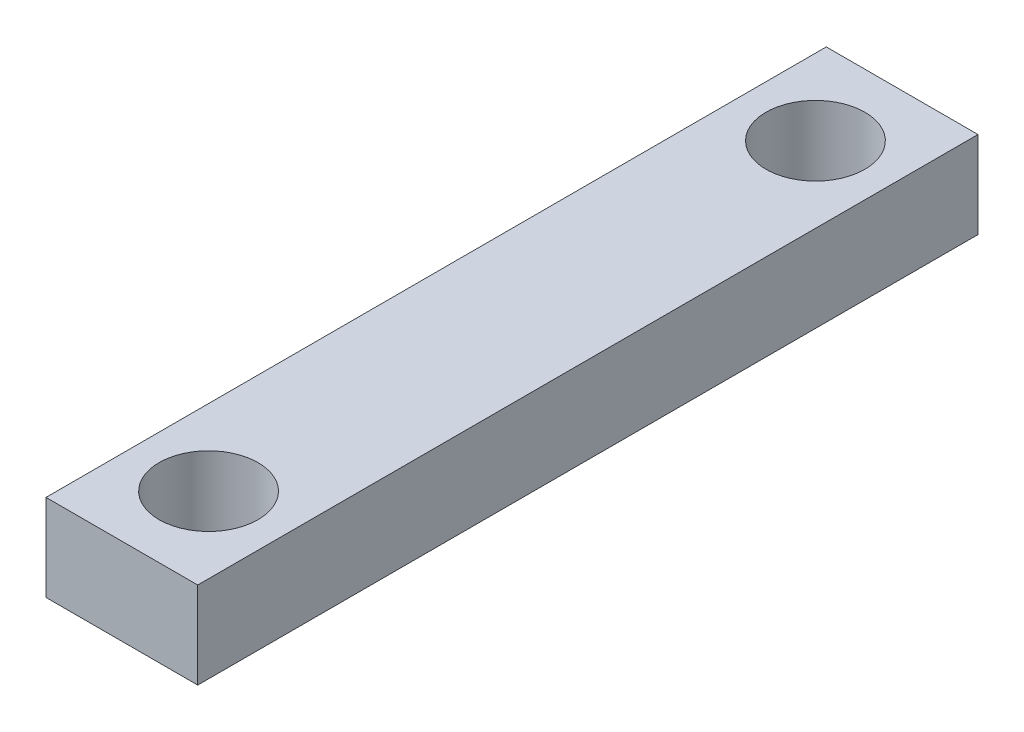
ISO-10303-21;
HEADER;
FILE_DESCRIPTION(('STEP AP214'),'2;1');
FILE_NAME('part.step','',(''),(''),'','','');
FILE_SCHEMA(('AUTOMOTIVE_DESIGN { 1 0 10303 214 1 1 1 1 }'));
ENDSEC;
DATA;
#1=APPLICATION_CONTEXT('core data for automotive mechanical design processes');
#2=APPLICATION_PROTOCOL_DEFINITION('international standard','automotive_design',2000,#1);
#3=PRODUCT_CONTEXT('',#1,'mechanical');
#4=PRODUCT('Part','Part','',(#3));
#5=PRODUCT_RELATED_PRODUCT_CATEGORY('part','',(#4));
#6=PRODUCT_DEFINITION_FORMATION('','',#4);
#7=PRODUCT_DEFINITION_CONTEXT('part definition',#1,'design');
#8=PRODUCT_DEFINITION('design','',#6,#7);
#9=PRODUCT_DEFINITION_SHAPE('','',#8);
#10=(LENGTH_UNIT() NAMED_UNIT(*) SI_UNIT(.MILLI.,.METRE.));
#11=(NAMED_UNIT(*) PLANE_ANGLE_UNIT() SI_UNIT($,.RADIAN.));
#12=(NAMED_UNIT(*) SI_UNIT($,.STERADIAN.) SOLID_ANGLE_UNIT());
#13=UNCERTAINTY_MEASURE_WITH_UNIT(LENGTH_MEASURE(1.E-05),#10,'distance_accuracy_value','');
#14=(GEOMETRIC_REPRESENTATION_CONTEXT(3) GLOBAL_UNCERTAINTY_ASSIGNED_CONTEXT((#13)) GLOBAL_UNIT_ASSIGNED_CONTEXT((#10,
#11,#12)) REPRESENTATION_CONTEXT('',''));
#15=CARTESIAN_POINT('',(0.,0.,0.));
#16=DIRECTION('',(0.,0.,1.));
#17=DIRECTION('',(1.,0.,0.));
#18=AXIS2_PLACEMENT_3D('',#15,#16,#17);
#19=CARTESIAN_POINT('',(-5.55625,6.35,0.));
#20=DIRECTION('',(0.,1.,0.));
#21=DIRECTION('',(0.,0.,1.));
#22=AXIS2_PLACEMENT_3D('',#19,#20,#21);
#23=PLANE('',#22);
#24=CARTESIAN_POINT('',(0.,6.35,-6.35));
#25=DIRECTION('',(0.,1.,0.));
#26=DIRECTION('',(0.,0.,1.));
#27=AXIS2_PLACEMENT_3D('',#24,#25,#26);
#28=CIRCLE('',#27,3.62244048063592);
#29=CARTESIAN_POINT('',(0.,6.35,-2.72755951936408));
#30=VERTEX_POINT('',#29);
#31=EDGE_CURVE('E97',#30,#30,#28,.T.);
#32=ORIENTED_EDGE('',*,*,#31,.F.);
#33=EDGE_LOOP('',(#32));
#34=FACE_BOUND('',#33,.T.);
#35=DIRECTION('',(0.,0.,1.));
#36=VECTOR('',#35,1.);
#37=CARTESIAN_POINT('',(-5.55625000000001,6.35,-57.15));
#38=LINE('',#37,#36);
#39=CARTESIAN_POINT('',(-5.55625000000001,6.35,-57.15));
#40=VERTEX_POINT('',#39);
#41=CARTESIAN_POINT('',(-5.55625,6.35,0.));
#42=VERTEX_POINT('',#41);
#43=EDGE_CURVE('E82',#40,#42,#38,.T.);
#44=ORIENTED_EDGE('',*,*,#43,.T.);
#45=DIRECTION('',(1.,0.,0.));
#46=VECTOR('',#45,1.);
#47=CARTESIAN_POINT('',(-5.55625,6.35,0.));
#48=LINE('',#47,#46);
#49=CARTESIAN_POINT('',(5.55625,6.35,0.));
#50=VERTEX_POINT('',#49);
#51=EDGE_CURVE('E77',#42,#50,#48,.T.);
#52=ORIENTED_EDGE('',*,*,#51,.T.);
#53=DIRECTION('',(0.,0.,-1.));
#54=VECTOR('',#53,1.);
#55=CARTESIAN_POINT('',(5.55624999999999,6.35,-57.15));
#56=LINE('',#55,#54);
#57=CARTESIAN_POINT('',(5.55624999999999,6.35,-57.15));
#58=VERTEX_POINT('',#57);
#59=EDGE_CURVE('E80',#50,#58,#56,.T.);
#60=ORIENTED_EDGE('',*,*,#59,.T.);
#61=DIRECTION('',(-1.,0.,0.));
#62=VECTOR('',#61,1.);
#63=CARTESIAN_POINT('',(-5.55625000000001,6.35,-57.15));
#64=LINE('',#63,#62);
#65=EDGE_CURVE('E47',#58,#40,#64,.T.);
#66=ORIENTED_EDGE('',*,*,#65,.T.);
#67=EDGE_LOOP('',(#44,#52,#60,#66));
#68=FACE_BOUND('',#67,.T.);
#69=CARTESIAN_POINT('',(0.,6.35,-50.8));
#70=DIRECTION('',(0.,1.,0.));
#71=DIRECTION('',(0.,0.,-1.));
#72=AXIS2_PLACEMENT_3D('',#69,#70,#71);
#73=CIRCLE('',#72,3.62244048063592);
#74=CARTESIAN_POINT('',(0.,6.35,-54.4224404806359));
#75=VERTEX_POINT('',#74);
#76=EDGE_CURVE('E112',#75,#75,#73,.T.);
#77=ORIENTED_EDGE('',*,*,#76,.F.);
#78=EDGE_LOOP('',(#77));
#79=FACE_BOUND('',#78,.T.);
#80=ADVANCED_FACE('F30',(#34,#68,#79),#23,.T.);
#81=CARTESIAN_POINT('',(-5.55625,0.,0.));
#82=DIRECTION('',(0.,1.,0.));
#83=DIRECTION('',(0.,0.,1.));
#84=AXIS2_PLACEMENT_3D('',#81,#82,#83);
#85=PLANE('',#84);
#86=CARTESIAN_POINT('',(0.,0.,-6.35));
#87=DIRECTION('',(0.,1.,0.));
#88=DIRECTION('',(0.,0.,1.));
#89=AXIS2_PLACEMENT_3D('',#86,#87,#88);
#90=CIRCLE('',#89,3.62244048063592);
#91=CARTESIAN_POINT('',(0.,0.,-2.72755951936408));
#92=VERTEX_POINT('',#91);
#93=EDGE_CURVE('E109',#92,#92,#90,.T.);
#94=ORIENTED_EDGE('',*,*,#93,.T.);
#95=EDGE_LOOP('',(#94));
#96=FACE_BOUND('',#95,.T.);
#97=DIRECTION('',(0.,0.,1.));
#98=VECTOR('',#97,1.);
#99=CARTESIAN_POINT('',(-5.55625000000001,0.,-57.15));
#100=LINE('',#99,#98);
#101=CARTESIAN_POINT('',(-5.55625000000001,0.,-57.15));
#102=VERTEX_POINT('',#101);
#103=CARTESIAN_POINT('',(-5.55625,0.,0.));
#104=VERTEX_POINT('',#103);
#105=EDGE_CURVE('E94',#102,#104,#100,.T.);
#106=ORIENTED_EDGE('',*,*,#105,.F.);
#107=DIRECTION('',(-1.,0.,0.));
#108=VECTOR('',#107,1.);
#109=CARTESIAN_POINT('',(-5.55625000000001,0.,-57.15));
#110=LINE('',#109,#108);
#111=CARTESIAN_POINT('',(5.55624999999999,0.,-57.15));
#112=VERTEX_POINT('',#111);
#113=EDGE_CURVE('E70',#112,#102,#110,.T.);
#114=ORIENTED_EDGE('',*,*,#113,.F.);
#115=DIRECTION('',(0.,0.,-1.));
#116=VECTOR('',#115,1.);
#117=CARTESIAN_POINT('',(5.55624999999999,0.,-57.15));
#118=LINE('',#117,#116);
#119=CARTESIAN_POINT('',(5.55625,0.,0.));
#120=VERTEX_POINT('',#119);
#121=EDGE_CURVE('E64',#120,#112,#118,.T.);
#122=ORIENTED_EDGE('',*,*,#121,.F.);
#123=DIRECTION('',(1.,0.,0.));
#124=VECTOR('',#123,1.);
#125=CARTESIAN_POINT('',(-5.55625,0.,0.));
#126=LINE('',#125,#124);
#127=EDGE_CURVE('E86',#104,#120,#126,.T.);
#128=ORIENTED_EDGE('',*,*,#127,.F.);
#129=EDGE_LOOP('',(#106,#114,#122,#128));
#130=FACE_BOUND('',#129,.T.);
#131=CARTESIAN_POINT('',(0.,0.,-50.8));
#132=DIRECTION('',(0.,1.,0.));
#133=DIRECTION('',(0.,0.,-1.));
#134=AXIS2_PLACEMENT_3D('',#131,#132,#133);
#135=CIRCLE('',#134,3.62244048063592);
#136=CARTESIAN_POINT('',(0.,0.,-54.4224404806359));
#137=VERTEX_POINT('',#136);
#138=EDGE_CURVE('E115',#137,#137,#135,.T.);
#139=ORIENTED_EDGE('',*,*,#138,.T.);
#140=EDGE_LOOP('',(#139));
#141=FACE_BOUND('',#140,.T.);
#142=ADVANCED_FACE('F105',(#96,#130,#141),#85,.F.);
#143=CARTESIAN_POINT('',(-5.55625000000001,6.35,-57.15));
#144=DIRECTION('',(1.,0.,0.));
#145=DIRECTION('',(0.,0.,-1.));
#146=AXIS2_PLACEMENT_3D('',#143,#144,#145);
#147=PLANE('',#146);
#148=ORIENTED_EDGE('',*,*,#105,.T.);
#149=DIRECTION('',(0.,-1.,0.));
#150=VECTOR('',#149,1.);
#151=CARTESIAN_POINT('',(-5.55625,6.35,0.));
#152=LINE('',#151,#150);
#153=EDGE_CURVE('E11',#42,#104,#152,.T.);
#154=ORIENTED_EDGE('',*,*,#153,.F.);
#155=ORIENTED_EDGE('',*,*,#43,.F.);
#156=DIRECTION('',(0.,-1.,0.));
#157=VECTOR('',#156,1.);
#158=CARTESIAN_POINT('',(-5.55625000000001,6.35,-57.15));
#159=LINE('',#158,#157);
#160=EDGE_CURVE('E90',#40,#102,#159,.T.);
#161=ORIENTED_EDGE('',*,*,#160,.T.);
#162=EDGE_LOOP('',(#148,#154,#155,#161));
#163=FACE_BOUND('',#162,.T.);
#164=ADVANCED_FACE('F32',(#163),#147,.F.);
#165=CARTESIAN_POINT('',(-5.55625,6.35,0.));
#166=DIRECTION('',(0.,0.,-1.));
#167=DIRECTION('',(-1.,0.,0.));
#168=AXIS2_PLACEMENT_3D('',#165,#166,#167);
#169=PLANE('',#168);
#170=ORIENTED_EDGE('',*,*,#127,.T.);
#171=DIRECTION('',(0.,-1.,0.));
#172=VECTOR('',#171,1.);
#173=CARTESIAN_POINT('',(5.55625,6.35,0.));
#174=LINE('',#173,#172);
#175=EDGE_CURVE('E39',#50,#120,#174,.T.);
#176=ORIENTED_EDGE('',*,*,#175,.F.);
#177=ORIENTED_EDGE('',*,*,#51,.F.);
#178=ORIENTED_EDGE('',*,*,#153,.T.);
#179=EDGE_LOOP('',(#170,#176,#177,#178));
#180=FACE_BOUND('',#179,.T.);
#181=ADVANCED_FACE('F85',(#180),#169,.F.);
#182=CARTESIAN_POINT('',(5.55624999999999,6.35,-57.15));
#183=DIRECTION('',(-1.,0.,0.));
#184=DIRECTION('',(0.,0.,1.));
#185=AXIS2_PLACEMENT_3D('',#182,#183,#184);
#186=PLANE('',#185);
#187=ORIENTED_EDGE('',*,*,#121,.T.);
#188=DIRECTION('',(0.,-1.,0.));
#189=VECTOR('',#188,1.);
#190=CARTESIAN_POINT('',(5.55624999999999,6.35,-57.15));
#191=LINE('',#190,#189);
#192=EDGE_CURVE('E87',#58,#112,#191,.T.);
#193=ORIENTED_EDGE('',*,*,#192,.F.);
#194=ORIENTED_EDGE('',*,*,#59,.F.);
#195=ORIENTED_EDGE('',*,*,#175,.T.);
#196=EDGE_LOOP('',(#187,#193,#194,#195));
#197=FACE_BOUND('',#196,.T.);
#198=ADVANCED_FACE('F88',(#197),#186,.F.);
#199=CARTESIAN_POINT('',(-5.55625000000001,6.35,-57.15));
#200=DIRECTION('',(0.,0.,1.));
#201=DIRECTION('',(1.,0.,0.));
#202=AXIS2_PLACEMENT_3D('',#199,#200,#201);
#203=PLANE('',#202);
#204=ORIENTED_EDGE('',*,*,#113,.T.);
#205=ORIENTED_EDGE('',*,*,#160,.F.);
#206=ORIENTED_EDGE('',*,*,#65,.F.);
#207=ORIENTED_EDGE('',*,*,#192,.T.);
#208=EDGE_LOOP('',(#204,#205,#206,#207));
#209=FACE_BOUND('',#208,.T.);
#210=ADVANCED_FACE('F102',(#209),#203,.F.);
#211=CARTESIAN_POINT('',(0.,6.35,-6.35));
#212=DIRECTION('',(0.,-1.,0.));
#213=DIRECTION('',(0.,0.,-1.));
#214=AXIS2_PLACEMENT_3D('',#211,#212,#213);
#215=CYLINDRICAL_SURFACE('',#214,3.62244048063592);
#216=ORIENTED_EDGE('',*,*,#31,.T.);
#217=EDGE_LOOP('',(#216));
#218=FACE_BOUND('',#217,.T.);
#219=ORIENTED_EDGE('',*,*,#93,.F.);
#220=EDGE_LOOP('',(#219));
#221=FACE_BOUND('',#220,.T.);
#222=ADVANCED_FACE('F133',(#218,#221),#215,.F.);
#223=CARTESIAN_POINT('',(0.,6.35,-50.8));
#224=DIRECTION('',(0.,-1.,0.));
#225=DIRECTION('',(0.,0.,-1.));
#226=AXIS2_PLACEMENT_3D('',#223,#224,#225);
#227=CYLINDRICAL_SURFACE('',#226,3.62244048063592);
#228=ORIENTED_EDGE('',*,*,#76,.T.);
#229=EDGE_LOOP('',(#228));
#230=FACE_BOUND('',#229,.T.);
#231=ORIENTED_EDGE('',*,*,#138,.F.);
#232=EDGE_LOOP('',(#231));
#233=FACE_BOUND('',#232,.T.);
#234=ADVANCED_FACE('F121',(#230,#233),#227,.F.);
#235=CLOSED_SHELL('',(#80,#142,#164,#181,#198,#210,#222,#234));
#236=MANIFOLD_SOLID_BREP('B2',#235);
#237=ADVANCED_BREP_SHAPE_REPRESENTATION('',(#18,#236),#14);
#238=SHAPE_DEFINITION_REPRESENTATION(#9,#237);
ENDSEC;
END-ISO-10303-21;
